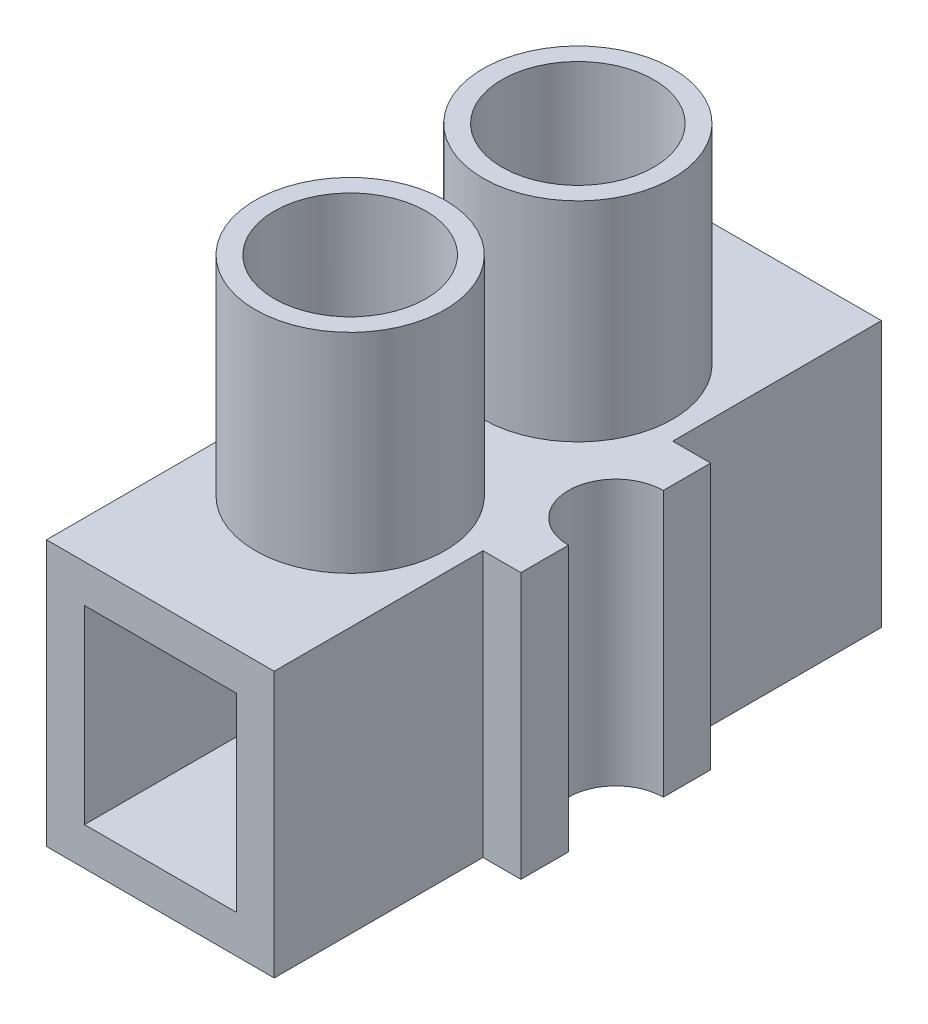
from build123d import *

# Parameters (mm, degrees)
BOSS_EXTRU_1_DEPTH      = 7
ESQUISSE2_R             = 2.5
BOSS_EXTRU_2_DEPTH      = 5.5
ESQUISSE4_W             = 4
ESQUISSE4_H             = 5
ENL_V_MAT_EXTRU_1_DEPTH = 12.75
ESQUISSE5_R             = 1.999904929
ENL_V_MAT_EXTRU_2_DEPTH = 11.5


with BuildPart() as part:
    # Esquisse1 → Boss.-Extru.1 (new body)
    with BuildSketch(Plane(origin=(0, 0, 0), x_dir=(1, 0, 0), z_dir=(0, 1, 0))):
        with BuildLine():
            Line((4, 2.5), (3, 2.5))
            Line((3, 2.5), (3, 8))
            Line((3, 8), (-3, 8))
            Line((-3, 8), (-3, 2.5))
            Line((-3, 2.5), (-4, 2.5))
            Line((-4, 2.5), (-4, 1.25))
            ThreePointArc((-4, 1.25), (-2.75, 0), (-4, -1.25))
            Line((-4, -1.25), (-4, -2.5))
            Line((-4, -2.5), (-3, -2.5))
            Line((-3, -2.5), (-3, -8))
            Line((-3, -8), (3, -8))
            Line((3, -8), (3, -2.5))
            Line((3, -2.5), (4, -2.5))
            Line((4, -2.5), (4, -1.25))
            ThreePointArc((4, -1.25), (2.75, 0), (4, 1.25))
            Line((4, 1.25), (4, 2.5))
        make_face()
    extrude(amount=BOSS_EXTRU_1_DEPTH)

    # Esquisse2 → Boss.-Extru.2 (add)
    with BuildSketch(Plane(origin=(0, 7, 0), x_dir=(1, 0, 0), z_dir=(0, 1, 0))):
        with Locations(Location((0, 3, 0), (0, 0, 90))):
            Circle(ESQUISSE2_R)
        with Locations(Location((0, -3, 0), (0, 0, 90))):
            Circle(ESQUISSE2_R)
    extrude(amount=BOSS_EXTRU_2_DEPTH)

    # Esquisse4 → Enl_v. mat.-Extru.1 (cut, symmetric)
    with BuildSketch(Plane.XY):
        with Locations((0, 3.5)):
            Rectangle(ESQUISSE4_W, ESQUISSE4_H)
    extrude(amount=ENL_V_MAT_EXTRU_1_DEPTH, both=True, mode=Mode.SUBTRACT)

    # Esquisse5 → Enl_v. mat.-Extru.2 (cut)
    with BuildSketch(Plane(origin=(0, 12.5, 0), x_dir=(1, 0, 0), z_dir=(0, 1, 0))):
        with Locations(Location((0, 3, 0), (0, 0, 270))):
            Circle(ESQUISSE5_R)
        with Locations(Location((0, -3, 0), (0, 0, 270))):
            Circle(ESQUISSE5_R)
    extrude(amount=-ENL_V_MAT_EXTRU_2_DEPTH, mode=Mode.SUBTRACT)


solid = part.part
